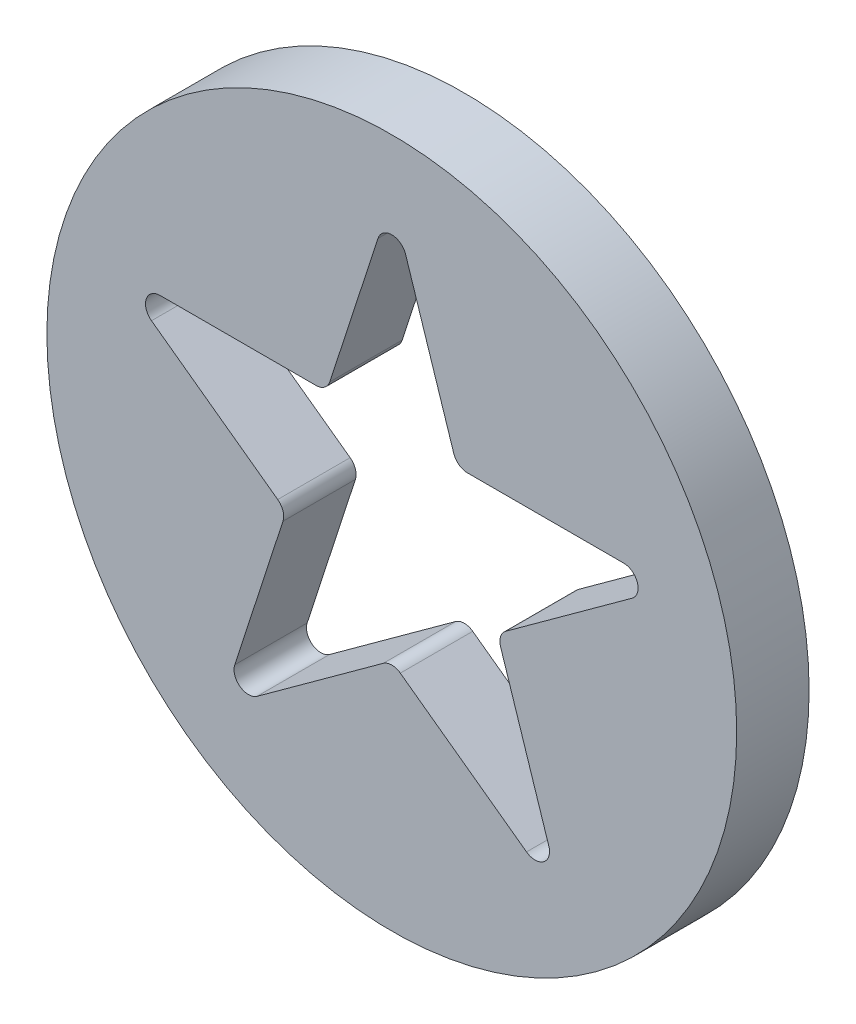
ISO-10303-21;
HEADER;
FILE_DESCRIPTION(('STEP AP214'),'2;1');
FILE_NAME('part.step','',(''),(''),'','','');
FILE_SCHEMA(('AUTOMOTIVE_DESIGN { 1 0 10303 214 1 1 1 1 }'));
ENDSEC;
DATA;
#1=APPLICATION_CONTEXT('core data for automotive mechanical design processes');
#2=APPLICATION_PROTOCOL_DEFINITION('international standard','automotive_design',2000,#1);
#3=PRODUCT_CONTEXT('',#1,'mechanical');
#4=PRODUCT('Part','Part','',(#3));
#5=PRODUCT_RELATED_PRODUCT_CATEGORY('part','',(#4));
#6=PRODUCT_DEFINITION_FORMATION('','',#4);
#7=PRODUCT_DEFINITION_CONTEXT('part definition',#1,'design');
#8=PRODUCT_DEFINITION('design','',#6,#7);
#9=PRODUCT_DEFINITION_SHAPE('','',#8);
#10=(LENGTH_UNIT() NAMED_UNIT(*) SI_UNIT(.MILLI.,.METRE.));
#11=(NAMED_UNIT(*) PLANE_ANGLE_UNIT() SI_UNIT($,.RADIAN.));
#12=(NAMED_UNIT(*) SI_UNIT($,.STERADIAN.) SOLID_ANGLE_UNIT());
#13=UNCERTAINTY_MEASURE_WITH_UNIT(LENGTH_MEASURE(1.E-05),#10,'distance_accuracy_value','');
#14=(GEOMETRIC_REPRESENTATION_CONTEXT(3) GLOBAL_UNCERTAINTY_ASSIGNED_CONTEXT((#13)) GLOBAL_UNIT_ASSIGNED_CONTEXT((#10,
#11,#12)) REPRESENTATION_CONTEXT('',''));
#15=CARTESIAN_POINT('',(0.,0.,0.));
#16=DIRECTION('',(0.,0.,1.));
#17=DIRECTION('',(1.,0.,0.));
#18=AXIS2_PLACEMENT_3D('',#15,#16,#17);
#19=CARTESIAN_POINT('',(-2.35848832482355,0.766319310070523,2.));
#20=DIRECTION('',(0.951056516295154,-0.309016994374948,0.));
#21=DIRECTION('',(0.309016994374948,0.951056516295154,0.));
#22=AXIS2_PLACEMENT_3D('',#19,#20,#21);
#23=PLANE('',#22);
#24=DIRECTION('',(-0.309016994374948,-0.951056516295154,0.));
#25=VECTOR('',#24,1.);
#26=CARTESIAN_POINT('',(-2.35848832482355,0.766319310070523,2.));
#27=LINE('',#26,#25);
#28=CARTESIAN_POINT('',(-0.380422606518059,6.85417960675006,2.));
#29=VERTEX_POINT('',#28);
#30=CARTESIAN_POINT('',(-1.71191916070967,2.75625458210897,2.));
#31=VERTEX_POINT('',#30);
#32=EDGE_CURVE('E201',#29,#31,#27,.T.);
#33=ORIENTED_EDGE('',*,*,#32,.T.);
#34=DIRECTION('',(0.,0.,-1.));
#35=VECTOR('',#34,1.);
#36=CARTESIAN_POINT('',(-1.71191916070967,2.75625458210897,0.));
#37=LINE('',#36,#35);
#38=CARTESIAN_POINT('',(-1.71191916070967,2.75625458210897,0.));
#39=VERTEX_POINT('',#38);
#40=EDGE_CURVE('E43',#31,#39,#37,.T.);
#41=ORIENTED_EDGE('',*,*,#40,.T.);
#42=DIRECTION('',(-0.309016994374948,-0.951056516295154,0.));
#43=VECTOR('',#42,1.);
#44=CARTESIAN_POINT('',(-2.35848832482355,0.766319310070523,0.));
#45=LINE('',#44,#43);
#46=CARTESIAN_POINT('',(-0.380422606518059,6.85417960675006,0.));
#47=VERTEX_POINT('',#46);
#48=EDGE_CURVE('E293',#47,#39,#45,.T.);
#49=ORIENTED_EDGE('',*,*,#48,.F.);
#50=DIRECTION('',(0.,0.,-1.));
#51=VECTOR('',#50,1.);
#52=CARTESIAN_POINT('',(-0.380422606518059,6.85417960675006,2.));
#53=LINE('',#52,#51);
#54=EDGE_CURVE('E185',#47,#29,#53,.F.);
#55=ORIENTED_EDGE('',*,*,#54,.T.);
#56=EDGE_LOOP('',(#33,#41,#49,#55));
#57=FACE_BOUND('',#56,.T.);
#58=ADVANCED_FACE('F35',(#57),#23,.T.);
#59=CARTESIAN_POINT('',(2.35848832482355,0.766319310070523,2.));
#60=DIRECTION('',(-0.951056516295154,-0.309016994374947,0.));
#61=DIRECTION('',(0.309016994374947,-0.951056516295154,0.));
#62=AXIS2_PLACEMENT_3D('',#59,#60,#61);
#63=PLANE('',#62);
#64=DIRECTION('',(-0.309016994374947,0.951056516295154,0.));
#65=VECTOR('',#64,1.);
#66=CARTESIAN_POINT('',(2.35848832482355,0.766319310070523,0.));
#67=LINE('',#66,#65);
#68=CARTESIAN_POINT('',(1.71191916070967,2.75625458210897,0.));
#69=VERTEX_POINT('',#68);
#70=CARTESIAN_POINT('',(0.380422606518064,6.85417960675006,0.));
#71=VERTEX_POINT('',#70);
#72=EDGE_CURVE('E299',#69,#71,#67,.T.);
#73=ORIENTED_EDGE('',*,*,#72,.F.);
#74=DIRECTION('',(0.,0.,-1.));
#75=VECTOR('',#74,1.);
#76=CARTESIAN_POINT('',(1.71191916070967,2.75625458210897,2.));
#77=LINE('',#76,#75);
#78=CARTESIAN_POINT('',(1.71191916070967,2.75625458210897,2.));
#79=VERTEX_POINT('',#78);
#80=EDGE_CURVE('E287',#69,#79,#77,.F.);
#81=ORIENTED_EDGE('',*,*,#80,.T.);
#82=DIRECTION('',(-0.309016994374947,0.951056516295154,0.));
#83=VECTOR('',#82,1.);
#84=CARTESIAN_POINT('',(2.35848832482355,0.766319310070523,2.));
#85=LINE('',#84,#83);
#86=CARTESIAN_POINT('',(0.380422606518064,6.85417960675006,2.));
#87=VERTEX_POINT('',#86);
#88=EDGE_CURVE('E402',#79,#87,#85,.T.);
#89=ORIENTED_EDGE('',*,*,#88,.T.);
#90=DIRECTION('',(0.,0.,-1.));
#91=VECTOR('',#90,1.);
#92=CARTESIAN_POINT('',(0.380422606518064,6.85417960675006,0.));
#93=LINE('',#92,#91);
#94=EDGE_CURVE('E225',#87,#71,#93,.T.);
#95=ORIENTED_EDGE('',*,*,#94,.T.);
#96=EDGE_LOOP('',(#73,#81,#89,#95));
#97=FACE_BOUND('',#96,.T.);
#98=ADVANCED_FACE('F363',(#97),#63,.T.);
#99=CARTESIAN_POINT('',(0.,2.47986137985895,2.));
#100=DIRECTION('',(0.,1.,0.));
#101=DIRECTION('',(-1.,0.,0.));
#102=AXIS2_PLACEMENT_3D('',#99,#100,#101);
#103=PLANE('',#102);
#104=DIRECTION('',(1.,0.,0.));
#105=VECTOR('',#104,1.);
#106=CARTESIAN_POINT('',(0.,2.47986137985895,2.));
#107=LINE('',#106,#105);
#108=CARTESIAN_POINT('',(2.09234176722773,2.47986137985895,2.));
#109=VERTEX_POINT('',#108);
#110=CARTESIAN_POINT('',(6.4011551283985,2.47986137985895,2.));
#111=VERTEX_POINT('',#110);
#112=EDGE_CURVE('E393',#109,#111,#107,.T.);
#113=ORIENTED_EDGE('',*,*,#112,.F.);
#114=DIRECTION('',(0.,0.,-1.));
#115=VECTOR('',#114,1.);
#116=CARTESIAN_POINT('',(2.09234176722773,2.47986137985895,0.));
#117=LINE('',#116,#115);
#118=CARTESIAN_POINT('',(2.09234176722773,2.47986137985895,0.));
#119=VERTEX_POINT('',#118);
#120=EDGE_CURVE('E284',#109,#119,#117,.T.);
#121=ORIENTED_EDGE('',*,*,#120,.T.);
#122=DIRECTION('',(1.,0.,0.));
#123=VECTOR('',#122,1.);
#124=CARTESIAN_POINT('',(0.,2.47986137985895,0.));
#125=LINE('',#124,#123);
#126=CARTESIAN_POINT('',(6.4011551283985,2.47986137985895,0.));
#127=VERTEX_POINT('',#126);
#128=EDGE_CURVE('E301',#119,#127,#125,.T.);
#129=ORIENTED_EDGE('',*,*,#128,.T.);
#130=DIRECTION('',(0.,0.,-1.));
#131=VECTOR('',#130,1.);
#132=CARTESIAN_POINT('',(6.4011551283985,2.47986137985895,2.));
#133=LINE('',#132,#131);
#134=EDGE_CURVE('E222',#127,#111,#133,.F.);
#135=ORIENTED_EDGE('',*,*,#134,.T.);
#136=EDGE_LOOP('',(#113,#121,#129,#135));
#137=FACE_BOUND('',#136,.T.);
#138=ADVANCED_FACE('F368',(#137),#103,.F.);
#139=CARTESIAN_POINT('',(1.45762594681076,-2.00625,2.));
#140=DIRECTION('',(0.587785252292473,-0.809016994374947,0.));
#141=DIRECTION('',(0.809016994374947,0.587785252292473,0.));
#142=AXIS2_PLACEMENT_3D('',#139,#140,#141);
#143=PLANE('',#142);
#144=DIRECTION('',(-0.809016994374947,-0.587785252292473,0.));
#145=VECTOR('',#144,1.);
#146=CARTESIAN_POINT('',(1.45762594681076,-2.00625,0.));
#147=LINE('',#146,#145);
#148=CARTESIAN_POINT('',(6.63626922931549,1.75625458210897,0.));
#149=VERTEX_POINT('',#148);
#150=CARTESIAN_POINT('',(3.1503659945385,-0.776402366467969,0.));
#151=VERTEX_POINT('',#150);
#152=EDGE_CURVE('E307',#149,#151,#147,.T.);
#153=ORIENTED_EDGE('',*,*,#152,.T.);
#154=DIRECTION('',(0.,0.,-1.));
#155=VECTOR('',#154,1.);
#156=CARTESIAN_POINT('',(3.1503659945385,-0.776402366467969,2.));
#157=LINE('',#156,#155);
#158=CARTESIAN_POINT('',(3.1503659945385,-0.776402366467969,2.));
#159=VERTEX_POINT('',#158);
#160=EDGE_CURVE('E282',#151,#159,#157,.F.);
#161=ORIENTED_EDGE('',*,*,#160,.T.);
#162=DIRECTION('',(-0.809016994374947,-0.587785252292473,0.));
#163=VECTOR('',#162,1.);
#164=CARTESIAN_POINT('',(1.45762594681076,-2.00625,2.));
#165=LINE('',#164,#163);
#166=CARTESIAN_POINT('',(6.63626922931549,1.75625458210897,2.));
#167=VERTEX_POINT('',#166);
#168=EDGE_CURVE('E390',#167,#159,#165,.T.);
#169=ORIENTED_EDGE('',*,*,#168,.F.);
#170=DIRECTION('',(0.,0.,-1.));
#171=VECTOR('',#170,1.);
#172=CARTESIAN_POINT('',(6.63626922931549,1.75625458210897,0.));
#173=LINE('',#172,#171);
#174=EDGE_CURVE('E219',#167,#149,#173,.T.);
#175=ORIENTED_EDGE('',*,*,#174,.T.);
#176=EDGE_LOOP('',(#153,#161,#169,#175));
#177=FACE_BOUND('',#176,.T.);
#178=ADVANCED_FACE('F395',(#177),#143,.F.);
#179=CARTESIAN_POINT('',(2.35848832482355,0.766319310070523,2.));
#180=DIRECTION('',(-0.951056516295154,-0.309016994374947,0.));
#181=DIRECTION('',(0.309016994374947,-0.951056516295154,0.));
#182=AXIS2_PLACEMENT_3D('',#179,#180,#181);
#183=PLANE('',#182);
#184=DIRECTION('',(-0.309016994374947,0.951056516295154,0.));
#185=VECTOR('',#184,1.);
#186=CARTESIAN_POINT('',(2.35848832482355,0.766319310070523,2.));
#187=LINE('',#186,#185);
#188=CARTESIAN_POINT('',(4.33655404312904,-5.32154098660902,2.));
#189=VERTEX_POINT('',#188);
#190=CARTESIAN_POINT('',(3.00505748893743,-1.22361596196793,2.));
#191=VERTEX_POINT('',#190);
#192=EDGE_CURVE('E398',#189,#191,#187,.T.);
#193=ORIENTED_EDGE('',*,*,#192,.T.);
#194=DIRECTION('',(0.,0.,-1.));
#195=VECTOR('',#194,1.);
#196=CARTESIAN_POINT('',(3.00505748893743,-1.22361596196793,0.));
#197=LINE('',#196,#195);
#198=CARTESIAN_POINT('',(3.00505748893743,-1.22361596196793,0.));
#199=VERTEX_POINT('',#198);
#200=EDGE_CURVE('E279',#191,#199,#197,.T.);
#201=ORIENTED_EDGE('',*,*,#200,.T.);
#202=DIRECTION('',(-0.309016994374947,0.951056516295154,0.));
#203=VECTOR('',#202,1.);
#204=CARTESIAN_POINT('',(2.35848832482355,0.766319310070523,0.));
#205=LINE('',#204,#203);
#206=CARTESIAN_POINT('',(4.33655404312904,-5.32154098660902,0.));
#207=VERTEX_POINT('',#206);
#208=EDGE_CURVE('E310',#207,#199,#205,.T.);
#209=ORIENTED_EDGE('',*,*,#208,.F.);
#210=DIRECTION('',(0.,0.,-1.));
#211=VECTOR('',#210,1.);
#212=CARTESIAN_POINT('',(4.33655404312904,-5.32154098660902,2.));
#213=LINE('',#212,#211);
#214=EDGE_CURVE('E217',#207,#189,#213,.F.);
#215=ORIENTED_EDGE('',*,*,#214,.T.);
#216=EDGE_LOOP('',(#193,#201,#209,#215));
#217=FACE_BOUND('',#216,.T.);
#218=ADVANCED_FACE('F434',(#217),#183,.T.);
#219=CARTESIAN_POINT('',(-1.45762594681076,-2.00625,2.));
#220=DIRECTION('',(0.587785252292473,0.809016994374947,0.));
#221=DIRECTION('',(-0.809016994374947,0.587785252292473,0.));
#222=AXIS2_PLACEMENT_3D('',#219,#220,#221);
#223=PLANE('',#222);
#224=DIRECTION('',(0.809016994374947,-0.587785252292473,0.));
#225=VECTOR('',#224,1.);
#226=CARTESIAN_POINT('',(-1.45762594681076,-2.00625,0.));
#227=LINE('',#226,#225);
#228=CARTESIAN_POINT('',(0.235114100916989,-3.23609763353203,0.));
#229=VERTEX_POINT('',#228);
#230=CARTESIAN_POINT('',(3.72101733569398,-5.76875458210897,0.));
#231=VERTEX_POINT('',#230);
#232=EDGE_CURVE('E313',#229,#231,#227,.T.);
#233=ORIENTED_EDGE('',*,*,#232,.F.);
#234=DIRECTION('',(0.,0.,-1.));
#235=VECTOR('',#234,1.);
#236=CARTESIAN_POINT('',(0.235114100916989,-3.23609763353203,2.));
#237=LINE('',#236,#235);
#238=CARTESIAN_POINT('',(0.235114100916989,-3.23609763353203,2.));
#239=VERTEX_POINT('',#238);
#240=EDGE_CURVE('E263',#229,#239,#237,.F.);
#241=ORIENTED_EDGE('',*,*,#240,.T.);
#242=DIRECTION('',(0.809016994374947,-0.587785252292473,0.));
#243=VECTOR('',#242,1.);
#244=CARTESIAN_POINT('',(-1.45762594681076,-2.00625,2.));
#245=LINE('',#244,#243);
#246=CARTESIAN_POINT('',(3.72101733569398,-5.76875458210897,2.));
#247=VERTEX_POINT('',#246);
#248=EDGE_CURVE('E337',#239,#247,#245,.T.);
#249=ORIENTED_EDGE('',*,*,#248,.T.);
#250=DIRECTION('',(0.,0.,-1.));
#251=VECTOR('',#250,1.);
#252=CARTESIAN_POINT('',(3.72101733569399,-5.76875458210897,0.));
#253=LINE('',#252,#251);
#254=EDGE_CURVE('E214',#247,#231,#253,.T.);
#255=ORIENTED_EDGE('',*,*,#254,.T.);
#256=EDGE_LOOP('',(#233,#241,#249,#255));
#257=FACE_BOUND('',#256,.T.);
#258=ADVANCED_FACE('F345',(#257),#223,.T.);
#259=CARTESIAN_POINT('',(1.45762594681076,-2.00625,2.));
#260=DIRECTION('',(0.587785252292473,-0.809016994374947,0.));
#261=DIRECTION('',(0.809016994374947,0.587785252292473,0.));
#262=AXIS2_PLACEMENT_3D('',#259,#260,#261);
#263=PLANE('',#262);
#264=DIRECTION('',(-0.809016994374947,-0.587785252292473,0.));
#265=VECTOR('',#264,1.);
#266=CARTESIAN_POINT('',(1.45762594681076,-2.00625,2.));
#267=LINE('',#266,#265);
#268=CARTESIAN_POINT('',(-0.235114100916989,-3.23609763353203,2.));
#269=VERTEX_POINT('',#268);
#270=CARTESIAN_POINT('',(-3.72101733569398,-5.76875458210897,2.));
#271=VERTEX_POINT('',#270);
#272=EDGE_CURVE('E328',#269,#271,#267,.T.);
#273=ORIENTED_EDGE('',*,*,#272,.F.);
#274=DIRECTION('',(0.,0.,-1.));
#275=VECTOR('',#274,1.);
#276=CARTESIAN_POINT('',(-0.235114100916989,-3.23609763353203,0.));
#277=LINE('',#276,#275);
#278=CARTESIAN_POINT('',(-0.235114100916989,-3.23609763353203,0.));
#279=VERTEX_POINT('',#278);
#280=EDGE_CURVE('E251',#269,#279,#277,.T.);
#281=ORIENTED_EDGE('',*,*,#280,.T.);
#282=DIRECTION('',(-0.809016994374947,-0.587785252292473,0.));
#283=VECTOR('',#282,1.);
#284=CARTESIAN_POINT('',(1.45762594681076,-2.00625,0.));
#285=LINE('',#284,#283);
#286=CARTESIAN_POINT('',(-3.72101733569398,-5.76875458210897,0.));
#287=VERTEX_POINT('',#286);
#288=EDGE_CURVE('E315',#279,#287,#285,.T.);
#289=ORIENTED_EDGE('',*,*,#288,.T.);
#290=DIRECTION('',(0.,0.,-1.));
#291=VECTOR('',#290,1.);
#292=CARTESIAN_POINT('',(-3.72101733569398,-5.76875458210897,2.));
#293=LINE('',#292,#291);
#294=EDGE_CURVE('E211',#287,#271,#293,.F.);
#295=ORIENTED_EDGE('',*,*,#294,.T.);
#296=EDGE_LOOP('',(#273,#281,#289,#295));
#297=FACE_BOUND('',#296,.T.);
#298=ADVANCED_FACE('F339',(#297),#263,.F.);
#299=CARTESIAN_POINT('',(-2.35848832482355,0.766319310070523,2.));
#300=DIRECTION('',(0.951056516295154,-0.309016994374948,0.));
#301=DIRECTION('',(0.309016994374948,0.951056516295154,0.));
#302=AXIS2_PLACEMENT_3D('',#299,#300,#301);
#303=PLANE('',#302);
#304=DIRECTION('',(-0.309016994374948,-0.951056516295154,0.));
#305=VECTOR('',#304,1.);
#306=CARTESIAN_POINT('',(-2.35848832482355,0.766319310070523,0.));
#307=LINE('',#306,#305);
#308=CARTESIAN_POINT('',(-3.00505748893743,-1.22361596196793,0.));
#309=VERTEX_POINT('',#308);
#310=CARTESIAN_POINT('',(-4.33655404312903,-5.32154098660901,0.));
#311=VERTEX_POINT('',#310);
#312=EDGE_CURVE('E203',#309,#311,#307,.T.);
#313=ORIENTED_EDGE('',*,*,#312,.F.);
#314=DIRECTION('',(0.,0.,-1.));
#315=VECTOR('',#314,1.);
#316=CARTESIAN_POINT('',(-3.00505748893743,-1.22361596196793,2.));
#317=LINE('',#316,#315);
#318=CARTESIAN_POINT('',(-3.00505748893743,-1.22361596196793,2.));
#319=VERTEX_POINT('',#318);
#320=EDGE_CURVE('E277',#309,#319,#317,.F.);
#321=ORIENTED_EDGE('',*,*,#320,.T.);
#322=DIRECTION('',(-0.309016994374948,-0.951056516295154,0.));
#323=VECTOR('',#322,1.);
#324=CARTESIAN_POINT('',(-2.35848832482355,0.766319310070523,2.));
#325=LINE('',#324,#323);
#326=CARTESIAN_POINT('',(-4.33655404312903,-5.32154098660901,2.));
#327=VERTEX_POINT('',#326);
#328=EDGE_CURVE('E326',#319,#327,#325,.T.);
#329=ORIENTED_EDGE('',*,*,#328,.T.);
#330=DIRECTION('',(0.,0.,-1.));
#331=VECTOR('',#330,1.);
#332=CARTESIAN_POINT('',(-4.33655404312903,-5.32154098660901,2.));
#333=LINE('',#332,#331);
#334=EDGE_CURVE('E208',#327,#311,#333,.T.);
#335=ORIENTED_EDGE('',*,*,#334,.T.);
#336=EDGE_LOOP('',(#313,#321,#329,#335));
#337=FACE_BOUND('',#336,.T.);
#338=ADVANCED_FACE('F325',(#337),#303,.T.);
#339=CARTESIAN_POINT('',(-1.45762594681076,-2.00625,2.));
#340=DIRECTION('',(0.587785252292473,0.809016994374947,0.));
#341=DIRECTION('',(-0.809016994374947,0.587785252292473,0.));
#342=AXIS2_PLACEMENT_3D('',#339,#340,#341);
#343=PLANE('',#342);
#344=DIRECTION('',(0.809016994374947,-0.587785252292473,0.));
#345=VECTOR('',#344,1.);
#346=CARTESIAN_POINT('',(-1.45762594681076,-2.00625,2.));
#347=LINE('',#346,#345);
#348=CARTESIAN_POINT('',(-6.6362692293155,1.75625458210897,2.));
#349=VERTEX_POINT('',#348);
#350=CARTESIAN_POINT('',(-3.1503659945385,-0.77640236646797,2.));
#351=VERTEX_POINT('',#350);
#352=EDGE_CURVE('E327',#349,#351,#347,.T.);
#353=ORIENTED_EDGE('',*,*,#352,.T.);
#354=DIRECTION('',(0.,0.,-1.));
#355=VECTOR('',#354,1.);
#356=CARTESIAN_POINT('',(-3.1503659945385,-0.77640236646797,2.));
#357=LINE('',#356,#355);
#358=CARTESIAN_POINT('',(-3.1503659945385,-0.77640236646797,0.));
#359=VERTEX_POINT('',#358);
#360=EDGE_CURVE('E274',#351,#359,#357,.T.);
#361=ORIENTED_EDGE('',*,*,#360,.T.);
#362=DIRECTION('',(0.809016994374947,-0.587785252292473,0.));
#363=VECTOR('',#362,1.);
#364=CARTESIAN_POINT('',(-1.45762594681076,-2.00625,0.));
#365=LINE('',#364,#363);
#366=CARTESIAN_POINT('',(-6.6362692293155,1.75625458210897,0.));
#367=VERTEX_POINT('',#366);
#368=EDGE_CURVE('E198',#367,#359,#365,.T.);
#369=ORIENTED_EDGE('',*,*,#368,.F.);
#370=DIRECTION('',(0.,0.,-1.));
#371=VECTOR('',#370,1.);
#372=CARTESIAN_POINT('',(-6.6362692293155,1.75625458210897,2.));
#373=LINE('',#372,#371);
#374=EDGE_CURVE('E179',#367,#349,#373,.F.);
#375=ORIENTED_EDGE('',*,*,#374,.T.);
#376=EDGE_LOOP('',(#353,#361,#369,#375));
#377=FACE_BOUND('',#376,.T.);
#378=ADVANCED_FACE('F424',(#377),#343,.T.);
#379=CARTESIAN_POINT('',(0.,2.47986137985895,2.));
#380=DIRECTION('',(0.,1.,0.));
#381=DIRECTION('',(-1.,0.,0.));
#382=AXIS2_PLACEMENT_3D('',#379,#380,#381);
#383=PLANE('',#382);
#384=DIRECTION('',(1.,0.,0.));
#385=VECTOR('',#384,1.);
#386=CARTESIAN_POINT('',(0.,2.47986137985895,0.));
#387=LINE('',#386,#385);
#388=CARTESIAN_POINT('',(-6.40115512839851,2.47986137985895,0.));
#389=VERTEX_POINT('',#388);
#390=CARTESIAN_POINT('',(-2.09234176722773,2.47986137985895,0.));
#391=VERTEX_POINT('',#390);
#392=EDGE_CURVE('E188',#389,#391,#387,.T.);
#393=ORIENTED_EDGE('',*,*,#392,.T.);
#394=DIRECTION('',(0.,0.,-1.));
#395=VECTOR('',#394,1.);
#396=CARTESIAN_POINT('',(-2.09234176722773,2.47986137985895,2.));
#397=LINE('',#396,#395);
#398=CARTESIAN_POINT('',(-2.09234176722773,2.47986137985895,2.));
#399=VERTEX_POINT('',#398);
#400=EDGE_CURVE('E11',#391,#399,#397,.F.);
#401=ORIENTED_EDGE('',*,*,#400,.T.);
#402=DIRECTION('',(1.,0.,0.));
#403=VECTOR('',#402,1.);
#404=CARTESIAN_POINT('',(0.,2.47986137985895,2.));
#405=LINE('',#404,#403);
#406=CARTESIAN_POINT('',(-6.40115512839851,2.47986137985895,2.));
#407=VERTEX_POINT('',#406);
#408=EDGE_CURVE('E189',#407,#399,#405,.T.);
#409=ORIENTED_EDGE('',*,*,#408,.F.);
#410=DIRECTION('',(0.,0.,-1.));
#411=VECTOR('',#410,1.);
#412=CARTESIAN_POINT('',(-6.40115512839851,2.47986137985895,2.));
#413=LINE('',#412,#411);
#414=EDGE_CURVE('E178',#407,#389,#413,.T.);
#415=ORIENTED_EDGE('',*,*,#414,.T.);
#416=EDGE_LOOP('',(#393,#401,#409,#415));
#417=FACE_BOUND('',#416,.T.);
#418=ADVANCED_FACE('F187',(#417),#383,.F.);
#419=CARTESIAN_POINT('',(0.,0.,2.));
#420=DIRECTION('',(0.,0.,-1.));
#421=DIRECTION('',(-1.,0.,0.));
#422=AXIS2_PLACEMENT_3D('',#419,#420,#421);
#423=CYLINDRICAL_SURFACE('',#422,9.525);
#424=CARTESIAN_POINT('',(0.,0.,2.));
#425=DIRECTION('',(0.,0.,1.));
#426=DIRECTION('',(1.,0.,0.));
#427=AXIS2_PLACEMENT_3D('',#424,#425,#426);
#428=CIRCLE('',#427,9.525);
#429=CARTESIAN_POINT('',(9.525,0.,2.));
#430=VERTEX_POINT('',#429);
#431=EDGE_CURVE('E190',#430,#430,#428,.T.);
#432=ORIENTED_EDGE('',*,*,#431,.F.);
#433=EDGE_LOOP('',(#432));
#434=FACE_BOUND('',#433,.T.);
#435=CARTESIAN_POINT('',(0.,0.,0.));
#436=DIRECTION('',(0.,0.,1.));
#437=DIRECTION('',(1.,0.,0.));
#438=AXIS2_PLACEMENT_3D('',#435,#436,#437);
#439=CIRCLE('',#438,9.525);
#440=CARTESIAN_POINT('',(9.525,0.,0.));
#441=VERTEX_POINT('',#440);
#442=EDGE_CURVE('E197',#441,#441,#439,.T.);
#443=ORIENTED_EDGE('',*,*,#442,.T.);
#444=EDGE_LOOP('',(#443));
#445=FACE_BOUND('',#444,.T.);
#446=ADVANCED_FACE('F410',(#434,#445),#423,.T.);
#447=CARTESIAN_POINT('',(0.,0.,2.));
#448=DIRECTION('',(0.,0.,1.));
#449=DIRECTION('',(1.,0.,0.));
#450=AXIS2_PLACEMENT_3D('',#447,#448,#449);
#451=PLANE('',#450);
#452=ORIENTED_EDGE('',*,*,#248,.F.);
#453=CARTESIAN_POINT('',(0.,-3.55970443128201,2.));
#454=DIRECTION('',(0.,0.,1.));
#455=DIRECTION('',(1.,0.,0.));
#456=AXIS2_PLACEMENT_3D('',#453,#454,#455);
#457=CIRCLE('',#456,0.4);
#458=EDGE_CURVE('E272',#239,#269,#457,.T.);
#459=ORIENTED_EDGE('',*,*,#458,.T.);
#460=ORIENTED_EDGE('',*,*,#272,.T.);
#461=CARTESIAN_POINT('',(-3.95613143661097,-5.44514778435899,2.));
#462=DIRECTION('',(0.,0.,1.));
#463=DIRECTION('',(1.,0.,0.));
#464=AXIS2_PLACEMENT_3D('',#461,#462,#463);
#465=CIRCLE('',#464,0.4);
#466=EDGE_CURVE('E233',#271,#327,#465,.F.);
#467=ORIENTED_EDGE('',*,*,#466,.T.);
#468=ORIENTED_EDGE('',*,*,#328,.F.);
#469=CARTESIAN_POINT('',(-3.38548009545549,-1.10000916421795,2.));
#470=DIRECTION('',(0.,0.,1.));
#471=DIRECTION('',(1.,0.,0.));
#472=AXIS2_PLACEMENT_3D('',#469,#470,#471);
#473=CIRCLE('',#472,0.4);
#474=EDGE_CURVE('E56',#319,#351,#473,.T.);
#475=ORIENTED_EDGE('',*,*,#474,.T.);
#476=ORIENTED_EDGE('',*,*,#352,.F.);
#477=CARTESIAN_POINT('',(-6.40115512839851,2.07986137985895,2.));
#478=DIRECTION('',(0.,0.,1.));
#479=DIRECTION('',(1.,0.,0.));
#480=AXIS2_PLACEMENT_3D('',#477,#478,#479);
#481=CIRCLE('',#480,0.4);
#482=EDGE_CURVE('E184',#349,#407,#481,.F.);
#483=ORIENTED_EDGE('',*,*,#482,.T.);
#484=ORIENTED_EDGE('',*,*,#408,.T.);
#485=CARTESIAN_POINT('',(-2.09234176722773,2.87986137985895,2.));
#486=DIRECTION('',(0.,0.,1.));
#487=DIRECTION('',(1.,0.,0.));
#488=AXIS2_PLACEMENT_3D('',#485,#486,#487);
#489=CIRCLE('',#488,0.4);
#490=EDGE_CURVE('E265',#399,#31,#489,.T.);
#491=ORIENTED_EDGE('',*,*,#490,.T.);
#492=ORIENTED_EDGE('',*,*,#32,.F.);
#493=CARTESIAN_POINT('',(0.,6.73057280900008,2.));
#494=DIRECTION('',(0.,0.,1.));
#495=DIRECTION('',(1.,0.,0.));
#496=AXIS2_PLACEMENT_3D('',#493,#494,#495);
#497=CIRCLE('',#496,0.4);
#498=EDGE_CURVE('E248',#29,#87,#497,.F.);
#499=ORIENTED_EDGE('',*,*,#498,.T.);
#500=ORIENTED_EDGE('',*,*,#88,.F.);
#501=CARTESIAN_POINT('',(2.09234176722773,2.87986137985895,2.));
#502=DIRECTION('',(0.,0.,1.));
#503=DIRECTION('',(1.,0.,0.));
#504=AXIS2_PLACEMENT_3D('',#501,#502,#503);
#505=CIRCLE('',#504,0.4);
#506=EDGE_CURVE('E267',#79,#109,#505,.T.);
#507=ORIENTED_EDGE('',*,*,#506,.T.);
#508=ORIENTED_EDGE('',*,*,#112,.T.);
#509=CARTESIAN_POINT('',(6.4011551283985,2.07986137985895,2.));
#510=DIRECTION('',(0.,0.,1.));
#511=DIRECTION('',(1.,0.,0.));
#512=AXIS2_PLACEMENT_3D('',#509,#510,#511);
#513=CIRCLE('',#512,0.4);
#514=EDGE_CURVE('E244',#111,#167,#513,.F.);
#515=ORIENTED_EDGE('',*,*,#514,.T.);
#516=ORIENTED_EDGE('',*,*,#168,.T.);
#517=CARTESIAN_POINT('',(3.38548009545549,-1.10000916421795,2.));
#518=DIRECTION('',(0.,0.,1.));
#519=DIRECTION('',(1.,0.,0.));
#520=AXIS2_PLACEMENT_3D('',#517,#518,#519);
#521=CIRCLE('',#520,0.4);
#522=EDGE_CURVE('E269',#159,#191,#521,.T.);
#523=ORIENTED_EDGE('',*,*,#522,.T.);
#524=ORIENTED_EDGE('',*,*,#192,.F.);
#525=CARTESIAN_POINT('',(3.95613143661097,-5.445147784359,2.));
#526=DIRECTION('',(0.,0.,1.));
#527=DIRECTION('',(1.,0.,0.));
#528=AXIS2_PLACEMENT_3D('',#525,#526,#527);
#529=CIRCLE('',#528,0.4);
#530=EDGE_CURVE('E238',#189,#247,#529,.F.);
#531=ORIENTED_EDGE('',*,*,#530,.T.);
#532=EDGE_LOOP('',(#452,#459,#460,#467,#468,#475,#476,#483,#484,#491,#492,#499,#500,#507,#508,
#515,#516,#523,#524,#531));
#533=FACE_BOUND('',#532,.T.);
#534=ORIENTED_EDGE('',*,*,#431,.T.);
#535=EDGE_LOOP('',(#534));
#536=FACE_BOUND('',#535,.T.);
#537=ADVANCED_FACE('F331',(#533,#536),#451,.T.);
#538=CARTESIAN_POINT('',(0.,0.,0.));
#539=DIRECTION('',(0.,0.,1.));
#540=DIRECTION('',(1.,0.,0.));
#541=AXIS2_PLACEMENT_3D('',#538,#539,#540);
#542=PLANE('',#541);
#543=ORIENTED_EDGE('',*,*,#288,.F.);
#544=CARTESIAN_POINT('',(0.,-3.55970443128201,0.));
#545=DIRECTION('',(0.,0.,1.));
#546=DIRECTION('',(1.,0.,0.));
#547=AXIS2_PLACEMENT_3D('',#544,#545,#546);
#548=CIRCLE('',#547,0.4);
#549=EDGE_CURVE('E261',#279,#229,#548,.F.);
#550=ORIENTED_EDGE('',*,*,#549,.T.);
#551=ORIENTED_EDGE('',*,*,#232,.T.);
#552=CARTESIAN_POINT('',(3.95613143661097,-5.445147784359,0.));
#553=DIRECTION('',(0.,0.,1.));
#554=DIRECTION('',(1.,0.,0.));
#555=AXIS2_PLACEMENT_3D('',#552,#553,#554);
#556=CIRCLE('',#555,0.4);
#557=EDGE_CURVE('E236',#231,#207,#556,.T.);
#558=ORIENTED_EDGE('',*,*,#557,.T.);
#559=ORIENTED_EDGE('',*,*,#208,.T.);
#560=CARTESIAN_POINT('',(3.38548009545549,-1.10000916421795,0.));
#561=DIRECTION('',(0.,0.,1.));
#562=DIRECTION('',(1.,0.,0.));
#563=AXIS2_PLACEMENT_3D('',#560,#561,#562);
#564=CIRCLE('',#563,0.4);
#565=EDGE_CURVE('E257',#199,#151,#564,.F.);
#566=ORIENTED_EDGE('',*,*,#565,.T.);
#567=ORIENTED_EDGE('',*,*,#152,.F.);
#568=CARTESIAN_POINT('',(6.4011551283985,2.07986137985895,0.));
#569=DIRECTION('',(0.,0.,1.));
#570=DIRECTION('',(1.,0.,0.));
#571=AXIS2_PLACEMENT_3D('',#568,#569,#570);
#572=CIRCLE('',#571,0.4);
#573=EDGE_CURVE('E241',#149,#127,#572,.T.);
#574=ORIENTED_EDGE('',*,*,#573,.T.);
#575=ORIENTED_EDGE('',*,*,#128,.F.);
#576=CARTESIAN_POINT('',(2.09234176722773,2.87986137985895,0.));
#577=DIRECTION('',(0.,0.,1.));
#578=DIRECTION('',(1.,0.,0.));
#579=AXIS2_PLACEMENT_3D('',#576,#577,#578);
#580=CIRCLE('',#579,0.4);
#581=EDGE_CURVE('E255',#119,#69,#580,.F.);
#582=ORIENTED_EDGE('',*,*,#581,.T.);
#583=ORIENTED_EDGE('',*,*,#72,.T.);
#584=CARTESIAN_POINT('',(0.,6.73057280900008,0.));
#585=DIRECTION('',(0.,0.,1.));
#586=DIRECTION('',(1.,0.,0.));
#587=AXIS2_PLACEMENT_3D('',#584,#585,#586);
#588=CIRCLE('',#587,0.4);
#589=EDGE_CURVE('E246',#71,#47,#588,.T.);
#590=ORIENTED_EDGE('',*,*,#589,.T.);
#591=ORIENTED_EDGE('',*,*,#48,.T.);
#592=CARTESIAN_POINT('',(-2.09234176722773,2.87986137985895,0.));
#593=DIRECTION('',(0.,0.,1.));
#594=DIRECTION('',(1.,0.,0.));
#595=AXIS2_PLACEMENT_3D('',#592,#593,#594);
#596=CIRCLE('',#595,0.4);
#597=EDGE_CURVE('E196',#39,#391,#596,.F.);
#598=ORIENTED_EDGE('',*,*,#597,.T.);
#599=ORIENTED_EDGE('',*,*,#392,.F.);
#600=CARTESIAN_POINT('',(-6.40115512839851,2.07986137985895,0.));
#601=DIRECTION('',(0.,0.,1.));
#602=DIRECTION('',(1.,0.,0.));
#603=AXIS2_PLACEMENT_3D('',#600,#601,#602);
#604=CIRCLE('',#603,0.4);
#605=EDGE_CURVE('E174',#389,#367,#604,.T.);
#606=ORIENTED_EDGE('',*,*,#605,.T.);
#607=ORIENTED_EDGE('',*,*,#368,.T.);
#608=CARTESIAN_POINT('',(-3.38548009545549,-1.10000916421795,0.));
#609=DIRECTION('',(0.,0.,1.));
#610=DIRECTION('',(1.,0.,0.));
#611=AXIS2_PLACEMENT_3D('',#608,#609,#610);
#612=CIRCLE('',#611,0.4);
#613=EDGE_CURVE('E259',#359,#309,#612,.F.);
#614=ORIENTED_EDGE('',*,*,#613,.T.);
#615=ORIENTED_EDGE('',*,*,#312,.T.);
#616=CARTESIAN_POINT('',(-3.95613143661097,-5.44514778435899,0.));
#617=DIRECTION('',(0.,0.,1.));
#618=DIRECTION('',(1.,0.,0.));
#619=AXIS2_PLACEMENT_3D('',#616,#617,#618);
#620=CIRCLE('',#619,0.4);
#621=EDGE_CURVE('E230',#311,#287,#620,.T.);
#622=ORIENTED_EDGE('',*,*,#621,.T.);
#623=EDGE_LOOP('',(#543,#550,#551,#558,#559,#566,#567,#574,#575,#582,#583,#590,#591,#598,#599,
#606,#607,#614,#615,#622));
#624=FACE_BOUND('',#623,.T.);
#625=ORIENTED_EDGE('',*,*,#442,.F.);
#626=EDGE_LOOP('',(#625));
#627=FACE_BOUND('',#626,.T.);
#628=ADVANCED_FACE('F193',(#624,#627),#542,.F.);
#629=CARTESIAN_POINT('',(-6.40115512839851,2.07986137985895,2.));
#630=DIRECTION('',(0.,0.,-1.));
#631=DIRECTION('',(-1.,0.,0.));
#632=AXIS2_PLACEMENT_3D('',#629,#630,#631);
#633=CYLINDRICAL_SURFACE('',#632,0.4);
#634=ORIENTED_EDGE('',*,*,#482,.F.);
#635=ORIENTED_EDGE('',*,*,#374,.F.);
#636=ORIENTED_EDGE('',*,*,#605,.F.);
#637=ORIENTED_EDGE('',*,*,#414,.F.);
#638=EDGE_LOOP('',(#634,#635,#636,#637));
#639=FACE_BOUND('',#638,.T.);
#640=ADVANCED_FACE('F177',(#639),#633,.F.);
#641=CARTESIAN_POINT('',(-3.95613143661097,-5.44514778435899,2.));
#642=DIRECTION('',(0.,0.,-1.));
#643=DIRECTION('',(-1.,0.,0.));
#644=AXIS2_PLACEMENT_3D('',#641,#642,#643);
#645=CYLINDRICAL_SURFACE('',#644,0.4);
#646=ORIENTED_EDGE('',*,*,#466,.F.);
#647=ORIENTED_EDGE('',*,*,#294,.F.);
#648=ORIENTED_EDGE('',*,*,#621,.F.);
#649=ORIENTED_EDGE('',*,*,#334,.F.);
#650=EDGE_LOOP('',(#646,#647,#648,#649));
#651=FACE_BOUND('',#650,.T.);
#652=ADVANCED_FACE('F324',(#651),#645,.F.);
#653=CARTESIAN_POINT('',(3.95613143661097,-5.445147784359,2.));
#654=DIRECTION('',(0.,0.,1.));
#655=DIRECTION('',(1.,0.,0.));
#656=AXIS2_PLACEMENT_3D('',#653,#654,#655);
#657=CYLINDRICAL_SURFACE('',#656,0.4);
#658=ORIENTED_EDGE('',*,*,#530,.F.);
#659=ORIENTED_EDGE('',*,*,#214,.F.);
#660=ORIENTED_EDGE('',*,*,#557,.F.);
#661=ORIENTED_EDGE('',*,*,#254,.F.);
#662=EDGE_LOOP('',(#658,#659,#660,#661));
#663=FACE_BOUND('',#662,.T.);
#664=ADVANCED_FACE('F377',(#663),#657,.F.);
#665=CARTESIAN_POINT('',(6.4011551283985,2.07986137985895,2.));
#666=DIRECTION('',(0.,0.,1.));
#667=DIRECTION('',(1.,0.,0.));
#668=AXIS2_PLACEMENT_3D('',#665,#666,#667);
#669=CYLINDRICAL_SURFACE('',#668,0.4);
#670=ORIENTED_EDGE('',*,*,#514,.F.);
#671=ORIENTED_EDGE('',*,*,#134,.F.);
#672=ORIENTED_EDGE('',*,*,#573,.F.);
#673=ORIENTED_EDGE('',*,*,#174,.F.);
#674=EDGE_LOOP('',(#670,#671,#672,#673));
#675=FACE_BOUND('',#674,.T.);
#676=ADVANCED_FACE('F359',(#675),#669,.F.);
#677=CARTESIAN_POINT('',(0.,6.73057280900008,2.));
#678=DIRECTION('',(0.,0.,1.));
#679=DIRECTION('',(1.,0.,0.));
#680=AXIS2_PLACEMENT_3D('',#677,#678,#679);
#681=CYLINDRICAL_SURFACE('',#680,0.4);
#682=ORIENTED_EDGE('',*,*,#498,.F.);
#683=ORIENTED_EDGE('',*,*,#54,.F.);
#684=ORIENTED_EDGE('',*,*,#589,.F.);
#685=ORIENTED_EDGE('',*,*,#94,.F.);
#686=EDGE_LOOP('',(#682,#683,#684,#685));
#687=FACE_BOUND('',#686,.T.);
#688=ADVANCED_FACE('F350',(#687),#681,.F.);
#689=CARTESIAN_POINT('',(0.,-3.55970443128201,2.));
#690=DIRECTION('',(0.,0.,1.));
#691=DIRECTION('',(1.,0.,0.));
#692=AXIS2_PLACEMENT_3D('',#689,#690,#691);
#693=CYLINDRICAL_SURFACE('',#692,0.4);
#694=ORIENTED_EDGE('',*,*,#458,.F.);
#695=ORIENTED_EDGE('',*,*,#240,.F.);
#696=ORIENTED_EDGE('',*,*,#549,.F.);
#697=ORIENTED_EDGE('',*,*,#280,.F.);
#698=EDGE_LOOP('',(#694,#695,#696,#697));
#699=FACE_BOUND('',#698,.T.);
#700=ADVANCED_FACE('F347',(#699),#693,.T.);
#701=CARTESIAN_POINT('',(-3.38548009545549,-1.10000916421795,2.));
#702=DIRECTION('',(0.,0.,-1.));
#703=DIRECTION('',(-1.,0.,0.));
#704=AXIS2_PLACEMENT_3D('',#701,#702,#703);
#705=CYLINDRICAL_SURFACE('',#704,0.4);
#706=ORIENTED_EDGE('',*,*,#474,.F.);
#707=ORIENTED_EDGE('',*,*,#320,.F.);
#708=ORIENTED_EDGE('',*,*,#613,.F.);
#709=ORIENTED_EDGE('',*,*,#360,.F.);
#710=EDGE_LOOP('',(#706,#707,#708,#709));
#711=FACE_BOUND('',#710,.T.);
#712=ADVANCED_FACE('F349',(#711),#705,.T.);
#713=CARTESIAN_POINT('',(3.38548009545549,-1.10000916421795,2.));
#714=DIRECTION('',(0.,0.,1.));
#715=DIRECTION('',(1.,0.,0.));
#716=AXIS2_PLACEMENT_3D('',#713,#714,#715);
#717=CYLINDRICAL_SURFACE('',#716,0.4);
#718=ORIENTED_EDGE('',*,*,#522,.F.);
#719=ORIENTED_EDGE('',*,*,#160,.F.);
#720=ORIENTED_EDGE('',*,*,#565,.F.);
#721=ORIENTED_EDGE('',*,*,#200,.F.);
#722=EDGE_LOOP('',(#718,#719,#720,#721));
#723=FACE_BOUND('',#722,.T.);
#724=ADVANCED_FACE('F356',(#723),#717,.T.);
#725=CARTESIAN_POINT('',(2.09234176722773,2.87986137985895,2.));
#726=DIRECTION('',(0.,0.,1.));
#727=DIRECTION('',(1.,0.,0.));
#728=AXIS2_PLACEMENT_3D('',#725,#726,#727);
#729=CYLINDRICAL_SURFACE('',#728,0.4);
#730=ORIENTED_EDGE('',*,*,#506,.F.);
#731=ORIENTED_EDGE('',*,*,#80,.F.);
#732=ORIENTED_EDGE('',*,*,#581,.F.);
#733=ORIENTED_EDGE('',*,*,#120,.F.);
#734=EDGE_LOOP('',(#730,#731,#732,#733));
#735=FACE_BOUND('',#734,.T.);
#736=ADVANCED_FACE('F447',(#735),#729,.T.);
#737=CARTESIAN_POINT('',(-2.09234176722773,2.87986137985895,2.));
#738=DIRECTION('',(0.,0.,1.));
#739=DIRECTION('',(1.,0.,0.));
#740=AXIS2_PLACEMENT_3D('',#737,#738,#739);
#741=CYLINDRICAL_SURFACE('',#740,0.4);
#742=ORIENTED_EDGE('',*,*,#490,.F.);
#743=ORIENTED_EDGE('',*,*,#400,.F.);
#744=ORIENTED_EDGE('',*,*,#597,.F.);
#745=ORIENTED_EDGE('',*,*,#40,.F.);
#746=EDGE_LOOP('',(#742,#743,#744,#745));
#747=FACE_BOUND('',#746,.T.);
#748=ADVANCED_FACE('F37',(#747),#741,.T.);
#749=CLOSED_SHELL('',(#58,#98,#138,#178,#218,#258,#298,#338,#378,#418,#446,#537,#628,#640,#652,
#664,#676,#688,#700,#712,#724,#736,#748));
#750=MANIFOLD_SOLID_BREP('B2',#749);
#751=ADVANCED_BREP_SHAPE_REPRESENTATION('',(#18,#750),#14);
#752=SHAPE_DEFINITION_REPRESENTATION(#9,#751);
ENDSEC;
END-ISO-10303-21;
